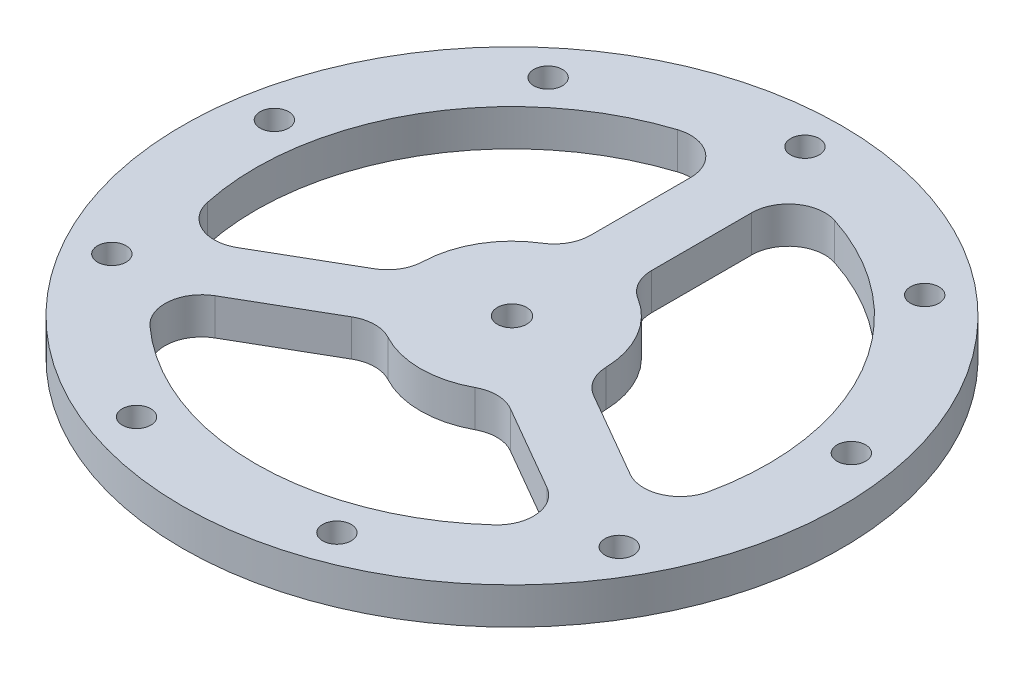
ISO-10303-21;
HEADER;
FILE_DESCRIPTION(('STEP AP214'),'2;1');
FILE_NAME('part.step','',(''),(''),'','','');
FILE_SCHEMA(('AUTOMOTIVE_DESIGN { 1 0 10303 214 1 1 1 1 }'));
ENDSEC;
DATA;
#1=APPLICATION_CONTEXT('core data for automotive mechanical design processes');
#2=APPLICATION_PROTOCOL_DEFINITION('international standard','automotive_design',2000,#1);
#3=PRODUCT_CONTEXT('',#1,'mechanical');
#4=PRODUCT('Part','Part','',(#3));
#5=PRODUCT_RELATED_PRODUCT_CATEGORY('part','',(#4));
#6=PRODUCT_DEFINITION_FORMATION('','',#4);
#7=PRODUCT_DEFINITION_CONTEXT('part definition',#1,'design');
#8=PRODUCT_DEFINITION('design','',#6,#7);
#9=PRODUCT_DEFINITION_SHAPE('','',#8);
#10=(LENGTH_UNIT() NAMED_UNIT(*) SI_UNIT(.MILLI.,.METRE.));
#11=(NAMED_UNIT(*) PLANE_ANGLE_UNIT() SI_UNIT($,.RADIAN.));
#12=(NAMED_UNIT(*) SI_UNIT($,.STERADIAN.) SOLID_ANGLE_UNIT());
#13=UNCERTAINTY_MEASURE_WITH_UNIT(LENGTH_MEASURE(1.E-05),#10,'distance_accuracy_value','');
#14=(GEOMETRIC_REPRESENTATION_CONTEXT(3) GLOBAL_UNCERTAINTY_ASSIGNED_CONTEXT((#13)) GLOBAL_UNIT_ASSIGNED_CONTEXT((#10,
#11,#12)) REPRESENTATION_CONTEXT('',''));
#15=CARTESIAN_POINT('',(0.,0.,0.));
#16=DIRECTION('',(0.,0.,1.));
#17=DIRECTION('',(1.,0.,0.));
#18=AXIS2_PLACEMENT_3D('',#15,#16,#17);
#19=CARTESIAN_POINT('',(0.,5.,0.));
#20=DIRECTION('',(0.,1.,0.));
#21=DIRECTION('',(0.,0.,1.));
#22=AXIS2_PLACEMENT_3D('',#19,#20,#21);
#23=PLANE('',#22);
#24=CARTESIAN_POINT('',(25.7115043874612,5.,-30.6417777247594));
#25=DIRECTION('',(0.,1.,0.));
#26=DIRECTION('',(-0.64278760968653,0.,0.766044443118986));
#27=AXIS2_PLACEMENT_3D('',#24,#25,#26);
#28=CIRCLE('',#27,1.95);
#29=CARTESIAN_POINT('',(24.4580685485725,5.,-29.1479910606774));
#30=VERTEX_POINT('',#29);
#31=EDGE_CURVE('E594',#30,#30,#28,.T.);
#32=ORIENTED_EDGE('',*,*,#31,.F.);
#33=EDGE_LOOP('',(#32));
#34=FACE_BOUND('',#33,.T.);
#35=CARTESIAN_POINT('',(39.3923101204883,5.,-6.94592710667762));
#36=DIRECTION('',(0.,1.,0.));
#37=DIRECTION('',(-0.984807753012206,0.,0.17364817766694));
#38=AXIS2_PLACEMENT_3D('',#35,#36,#37);
#39=CIRCLE('',#38,1.95);
#40=CARTESIAN_POINT('',(37.4719350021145,5.,-6.60731316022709));
#41=VERTEX_POINT('',#40);
#42=EDGE_CURVE('E600',#41,#41,#39,.T.);
#43=ORIENTED_EDGE('',*,*,#42,.F.);
#44=EDGE_LOOP('',(#43));
#45=FACE_BOUND('',#44,.T.);
#46=CARTESIAN_POINT('',(34.6410161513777,5.,19.9999999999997));
#47=DIRECTION('',(0.,1.,0.));
#48=DIRECTION('',(-0.866025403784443,0.,-0.499999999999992));
#49=AXIS2_PLACEMENT_3D('',#46,#47,#48);
#50=CIRCLE('',#49,1.95);
#51=CARTESIAN_POINT('',(32.9522666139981,5.,19.0249999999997));
#52=VERTEX_POINT('',#51);
#53=EDGE_CURVE('E606',#52,#52,#50,.T.);
#54=ORIENTED_EDGE('',*,*,#53,.F.);
#55=EDGE_LOOP('',(#54));
#56=FACE_BOUND('',#55,.T.);
#57=CARTESIAN_POINT('',(13.680805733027,5.,37.5877048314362));
#58=DIRECTION('',(0.,1.,0.));
#59=DIRECTION('',(-0.342020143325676,0.,-0.939692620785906));
#60=AXIS2_PLACEMENT_3D('',#57,#58,#59);
#61=CIRCLE('',#60,1.95);
#62=CARTESIAN_POINT('',(13.013866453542,5.,35.7553042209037));
#63=VERTEX_POINT('',#62);
#64=EDGE_CURVE('E612',#63,#63,#61,.T.);
#65=ORIENTED_EDGE('',*,*,#64,.F.);
#66=EDGE_LOOP('',(#65));
#67=FACE_BOUND('',#66,.T.);
#68=CARTESIAN_POINT('',(-13.6808057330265,5.,37.5877048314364));
#69=DIRECTION('',(0.,1.,0.));
#70=DIRECTION('',(0.342020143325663,0.,-0.939692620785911));
#71=AXIS2_PLACEMENT_3D('',#68,#69,#70);
#72=CIRCLE('',#71,1.95);
#73=CARTESIAN_POINT('',(-13.0138664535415,5.,35.7553042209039));
#74=VERTEX_POINT('',#73);
#75=EDGE_CURVE('E618',#74,#74,#72,.T.);
#76=ORIENTED_EDGE('',*,*,#75,.F.);
#77=EDGE_LOOP('',(#76));
#78=FACE_BOUND('',#77,.T.);
#79=CARTESIAN_POINT('',(-34.6410161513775,5.,20.0000000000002));
#80=DIRECTION('',(0.,1.,0.));
#81=DIRECTION('',(0.866025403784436,0.,-0.500000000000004));
#82=AXIS2_PLACEMENT_3D('',#79,#80,#81);
#83=CIRCLE('',#82,1.95);
#84=CARTESIAN_POINT('',(-32.9522666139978,5.,19.0250000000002));
#85=VERTEX_POINT('',#84);
#86=EDGE_CURVE('E624',#85,#85,#83,.T.);
#87=ORIENTED_EDGE('',*,*,#86,.F.);
#88=EDGE_LOOP('',(#87));
#89=FACE_BOUND('',#88,.T.);
#90=CARTESIAN_POINT('',(-39.3923101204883,5.,-6.9459271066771));
#91=DIRECTION('',(0.,1.,0.));
#92=DIRECTION('',(0.984807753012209,0.,0.173648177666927));
#93=AXIS2_PLACEMENT_3D('',#90,#91,#92);
#94=CIRCLE('',#93,1.95);
#95=CARTESIAN_POINT('',(-37.4719350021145,5.,-6.60731316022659));
#96=VERTEX_POINT('',#95);
#97=EDGE_CURVE('E630',#96,#96,#94,.T.);
#98=ORIENTED_EDGE('',*,*,#97,.F.);
#99=EDGE_LOOP('',(#98));
#100=FACE_BOUND('',#99,.T.);
#101=CARTESIAN_POINT('',(-25.7115043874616,5.,-30.6417777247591));
#102=DIRECTION('',(0.,1.,0.));
#103=DIRECTION('',(0.642787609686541,0.,0.766044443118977));
#104=AXIS2_PLACEMENT_3D('',#101,#102,#103);
#105=CIRCLE('',#104,1.95);
#106=CARTESIAN_POINT('',(-24.4580685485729,5.,-29.1479910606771));
#107=VERTEX_POINT('',#106);
#108=EDGE_CURVE('E588',#107,#107,#105,.T.);
#109=ORIENTED_EDGE('',*,*,#108,.F.);
#110=EDGE_LOOP('',(#109));
#111=FACE_BOUND('',#110,.T.);
#112=CARTESIAN_POINT('',(0.,5.,-40.));
#113=DIRECTION('',(0.,1.,0.));
#114=DIRECTION('',(0.,0.,1.));
#115=AXIS2_PLACEMENT_3D('',#112,#113,#114);
#116=CIRCLE('',#115,1.95);
#117=CARTESIAN_POINT('',(0.,5.,-38.05));
#118=VERTEX_POINT('',#117);
#119=EDGE_CURVE('E582',#118,#118,#116,.T.);
#120=ORIENTED_EDGE('',*,*,#119,.F.);
#121=EDGE_LOOP('',(#120));
#122=FACE_BOUND('',#121,.T.);
#123=CARTESIAN_POINT('',(0.,5.,0.));
#124=DIRECTION('',(0.,1.,0.));
#125=DIRECTION('',(0.,0.,1.));
#126=AXIS2_PLACEMENT_3D('',#123,#124,#125);
#127=CIRCLE('',#126,2.);
#128=CARTESIAN_POINT('',(0.,5.,2.));
#129=VERTEX_POINT('',#128);
#130=EDGE_CURVE('E485',#129,#129,#127,.T.);
#131=ORIENTED_EDGE('',*,*,#130,.F.);
#132=EDGE_LOOP('',(#131));
#133=FACE_BOUND('',#132,.T.);
#134=CARTESIAN_POINT('',(0.,5.,0.));
#135=DIRECTION('',(0.,1.,0.));
#136=DIRECTION('',(0.,0.,1.));
#137=AXIS2_PLACEMENT_3D('',#134,#135,#136);
#138=CIRCLE('',#137,45.);
#139=CARTESIAN_POINT('',(0.,5.,45.));
#140=VERTEX_POINT('',#139);
#141=EDGE_CURVE('E353',#140,#140,#138,.T.);
#142=ORIENTED_EDGE('',*,*,#141,.T.);
#143=EDGE_LOOP('',(#142));
#144=FACE_BOUND('',#143,.T.);
#145=DIRECTION('',(0.866025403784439,0.,0.5));
#146=VECTOR('',#145,1.);
#147=CARTESIAN_POINT('',(2.08333333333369,5.,-3.60843918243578));
#148=LINE('',#147,#146);
#149=CARTESIAN_POINT('',(14.9932778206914,5.,3.84512074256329));
#150=VERTEX_POINT('',#149);
#151=CARTESIAN_POINT('',(26.8215460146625,5.,10.6741745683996));
#152=VERTEX_POINT('',#151);
#153=EDGE_CURVE('E322',#150,#152,#148,.T.);
#154=ORIENTED_EDGE('',*,*,#153,.F.);
#155=CARTESIAN_POINT('',(17.4932778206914,5.,-0.485006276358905));
#156=DIRECTION('',(0.,1.,0.));
#157=DIRECTION('',(0.,0.,1.));
#158=AXIS2_PLACEMENT_3D('',#155,#156,#157);
#159=CIRCLE('',#158,5.);
#160=CARTESIAN_POINT('',(12.495198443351,5.,-0.346433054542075));
#161=VERTEX_POINT('',#160);
#162=EDGE_CURVE('E446',#150,#161,#159,.F.);
#163=ORIENTED_EDGE('',*,*,#162,.T.);
#164=CARTESIAN_POINT('',(0.,5.,0.));
#165=DIRECTION('',(0.,1.,0.));
#166=DIRECTION('',(0.,0.,1.));
#167=AXIS2_PLACEMENT_3D('',#164,#165,#166);
#168=CIRCLE('',#167,12.5);
#169=CARTESIAN_POINT('',(6.54761904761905,5.,-10.647942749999));
#170=VERTEX_POINT('',#169);
#171=EDGE_CURVE('E324',#161,#170,#168,.T.);
#172=ORIENTED_EDGE('',*,*,#171,.T.);
#173=CARTESIAN_POINT('',(9.16666666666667,5.,-14.9071198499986));
#174=DIRECTION('',(0.,1.,0.));
#175=DIRECTION('',(0.,0.,1.));
#176=AXIS2_PLACEMENT_3D('',#173,#174,#175);
#177=CIRCLE('',#176,5.);
#178=CARTESIAN_POINT('',(4.16666666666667,5.,-14.9071198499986));
#179=VERTEX_POINT('',#178);
#180=EDGE_CURVE('E450',#170,#179,#177,.F.);
#181=ORIENTED_EDGE('',*,*,#180,.T.);
#182=DIRECTION('',(0.,0.,1.));
#183=VECTOR('',#182,1.);
#184=CARTESIAN_POINT('',(4.16666666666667,5.,0.));
#185=LINE('',#184,#183);
#186=CARTESIAN_POINT('',(4.16666666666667,5.,-28.565227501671));
#187=VERTEX_POINT('',#186);
#188=EDGE_CURVE('E321',#179,#187,#185,.F.);
#189=ORIENTED_EDGE('',*,*,#188,.T.);
#190=CARTESIAN_POINT('',(9.16666666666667,5.,-28.565227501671));
#191=DIRECTION('',(0.,1.,0.));
#192=DIRECTION('',(0.,0.,1.));
#193=AXIS2_PLACEMENT_3D('',#190,#191,#192);
#194=CIRCLE('',#193,5.);
#195=CARTESIAN_POINT('',(10.6944444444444,5.,-33.3260987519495));
#196=VERTEX_POINT('',#195);
#197=EDGE_CURVE('E320',#187,#196,#194,.F.);
#198=ORIENTED_EDGE('',*,*,#197,.T.);
#199=CARTESIAN_POINT('',(0.,5.,0.));
#200=DIRECTION('',(0.,1.,0.));
#201=DIRECTION('',(0.,0.,1.));
#202=AXIS2_PLACEMENT_3D('',#199,#200,#201);
#203=CIRCLE('',#202,35.);
#204=CARTESIAN_POINT('',(34.2084703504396,5.,7.40138880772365));
#205=VERTEX_POINT('',#204);
#206=EDGE_CURVE('E312',#205,#196,#203,.T.);
#207=ORIENTED_EDGE('',*,*,#206,.F.);
#208=CARTESIAN_POINT('',(29.3215460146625,5.,6.34404754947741));
#209=DIRECTION('',(0.,1.,0.));
#210=DIRECTION('',(0.,0.,1.));
#211=AXIS2_PLACEMENT_3D('',#208,#209,#210);
#212=CIRCLE('',#211,5.);
#213=EDGE_CURVE('E295',#205,#152,#212,.F.);
#214=ORIENTED_EDGE('',*,*,#213,.T.);
#215=EDGE_LOOP('',(#154,#163,#172,#181,#189,#198,#207,#214));
#216=FACE_BOUND('',#215,.T.);
#217=DIRECTION('',(-0.866025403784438,0.,0.5));
#218=VECTOR('',#217,1.);
#219=CARTESIAN_POINT('',(2.08333333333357,5.,3.60843918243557));
#220=LINE('',#219,#218);
#221=CARTESIAN_POINT('',(-10.8266111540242,5.,11.0619991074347));
#222=VERTEX_POINT('',#221);
#223=CARTESIAN_POINT('',(-22.6548793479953,5.,17.891052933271));
#224=VERTEX_POINT('',#223);
#225=EDGE_CURVE('E332',#222,#224,#220,.T.);
#226=ORIENTED_EDGE('',*,*,#225,.F.);
#227=CARTESIAN_POINT('',(-8.32661115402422,5.,15.3921261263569));
#228=DIRECTION('',(0.,1.,0.));
#229=DIRECTION('',(0.,0.,1.));
#230=AXIS2_PLACEMENT_3D('',#227,#228,#229);
#231=CIRCLE('',#230,5.);
#232=CARTESIAN_POINT('',(-5.94757939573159,5.,10.9943758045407));
#233=VERTEX_POINT('',#232);
#234=EDGE_CURVE('E438',#222,#233,#231,.F.);
#235=ORIENTED_EDGE('',*,*,#234,.T.);
#236=CARTESIAN_POINT('',(0.,5.,0.));
#237=DIRECTION('',(0.,1.,0.));
#238=DIRECTION('',(0.,0.,1.));
#239=AXIS2_PLACEMENT_3D('',#236,#237,#238);
#240=CIRCLE('',#239,12.5);
#241=CARTESIAN_POINT('',(5.94757939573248,5.,10.9943758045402));
#242=VERTEX_POINT('',#241);
#243=EDGE_CURVE('E339',#233,#242,#240,.T.);
#244=ORIENTED_EDGE('',*,*,#243,.T.);
#245=CARTESIAN_POINT('',(8.32661115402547,5.,15.3921261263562));
#246=DIRECTION('',(0.,1.,0.));
#247=DIRECTION('',(0.,0.,1.));
#248=AXIS2_PLACEMENT_3D('',#245,#246,#247);
#249=CIRCLE('',#248,5.);
#250=CARTESIAN_POINT('',(10.8266111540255,5.,11.0619991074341));
#251=VERTEX_POINT('',#250);
#252=EDGE_CURVE('E442',#242,#251,#249,.F.);
#253=ORIENTED_EDGE('',*,*,#252,.T.);
#254=DIRECTION('',(0.866025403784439,0.,0.5));
#255=VECTOR('',#254,1.);
#256=CARTESIAN_POINT('',(8.12287392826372,5.,9.5009956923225));
#257=LINE('',#256,#255);
#258=CARTESIAN_POINT('',(22.6548793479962,5.,17.8910529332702));
#259=VERTEX_POINT('',#258);
#260=EDGE_CURVE('E337',#251,#259,#257,.T.);
#261=ORIENTED_EDGE('',*,*,#260,.T.);
#262=CARTESIAN_POINT('',(20.1548793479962,5.,22.2211799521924));
#263=DIRECTION('',(0.,1.,0.));
#264=DIRECTION('',(0.,0.,1.));
#265=AXIS2_PLACEMENT_3D('',#262,#263,#264);
#266=CIRCLE('',#265,5.);
#267=CARTESIAN_POINT('',(23.5140259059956,5.,25.9247099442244));
#268=VERTEX_POINT('',#267);
#269=EDGE_CURVE('E381',#259,#268,#266,.F.);
#270=ORIENTED_EDGE('',*,*,#269,.T.);
#271=CARTESIAN_POINT('',(0.,5.,0.));
#272=DIRECTION('',(0.,1.,0.));
#273=DIRECTION('',(0.,0.,1.));
#274=AXIS2_PLACEMENT_3D('',#271,#272,#273);
#275=CIRCLE('',#274,35.);
#276=CARTESIAN_POINT('',(-23.5140259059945,5.,25.9247099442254));
#277=VERTEX_POINT('',#276);
#278=EDGE_CURVE('E334',#277,#268,#275,.T.);
#279=ORIENTED_EDGE('',*,*,#278,.F.);
#280=CARTESIAN_POINT('',(-20.1548793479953,5.,22.2211799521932));
#281=DIRECTION('',(0.,1.,0.));
#282=DIRECTION('',(0.,0.,1.));
#283=AXIS2_PLACEMENT_3D('',#280,#281,#282);
#284=CIRCLE('',#283,5.);
#285=EDGE_CURVE('E386',#277,#224,#284,.F.);
#286=ORIENTED_EDGE('',*,*,#285,.T.);
#287=EDGE_LOOP('',(#226,#235,#244,#253,#261,#270,#279,#286));
#288=FACE_BOUND('',#287,.T.);
#289=DIRECTION('',(0.,0.,-1.));
#290=VECTOR('',#289,1.);
#291=CARTESIAN_POINT('',(-4.16666666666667,5.,0.));
#292=LINE('',#291,#290);
#293=CARTESIAN_POINT('',(-4.16666666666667,5.,-14.9071198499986));
#294=VERTEX_POINT('',#293);
#295=CARTESIAN_POINT('',(-4.16666666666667,5.,-28.565227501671));
#296=VERTEX_POINT('',#295);
#297=EDGE_CURVE('E342',#294,#296,#292,.T.);
#298=ORIENTED_EDGE('',*,*,#297,.F.);
#299=CARTESIAN_POINT('',(-9.16666666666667,5.,-14.9071198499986));
#300=DIRECTION('',(0.,1.,0.));
#301=DIRECTION('',(0.,0.,1.));
#302=AXIS2_PLACEMENT_3D('',#299,#300,#301);
#303=CIRCLE('',#302,5.);
#304=CARTESIAN_POINT('',(-6.54761904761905,5.,-10.647942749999));
#305=VERTEX_POINT('',#304);
#306=EDGE_CURVE('E142',#294,#305,#303,.F.);
#307=ORIENTED_EDGE('',*,*,#306,.T.);
#308=CARTESIAN_POINT('',(0.,5.,0.));
#309=DIRECTION('',(0.,1.,0.));
#310=DIRECTION('',(0.,0.,1.));
#311=AXIS2_PLACEMENT_3D('',#308,#309,#310);
#312=CIRCLE('',#311,12.5);
#313=CARTESIAN_POINT('',(-12.495198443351,5.,-0.346433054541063));
#314=VERTEX_POINT('',#313);
#315=EDGE_CURVE('E349',#305,#314,#312,.T.);
#316=ORIENTED_EDGE('',*,*,#315,.T.);
#317=CARTESIAN_POINT('',(-17.4932778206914,5.,-0.485006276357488));
#318=DIRECTION('',(0.,1.,0.));
#319=DIRECTION('',(0.,0.,1.));
#320=AXIS2_PLACEMENT_3D('',#317,#318,#319);
#321=CIRCLE('',#320,5.);
#322=CARTESIAN_POINT('',(-14.9932778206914,5.,3.84512074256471));
#323=VERTEX_POINT('',#322);
#324=EDGE_CURVE('E434',#314,#323,#321,.F.);
#325=ORIENTED_EDGE('',*,*,#324,.T.);
#326=DIRECTION('',(-0.866025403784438,0.,0.5));
#327=VECTOR('',#326,1.);
#328=CARTESIAN_POINT('',(-12.2895405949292,5.,2.28411732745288));
#329=LINE('',#328,#327);
#330=CARTESIAN_POINT('',(-26.8215460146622,5.,10.6741745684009));
#331=VERTEX_POINT('',#330);
#332=EDGE_CURVE('E347',#323,#331,#329,.T.);
#333=ORIENTED_EDGE('',*,*,#332,.T.);
#334=CARTESIAN_POINT('',(-29.3215460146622,5.,6.34404754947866));
#335=DIRECTION('',(0.,1.,0.));
#336=DIRECTION('',(0.,0.,1.));
#337=AXIS2_PLACEMENT_3D('',#334,#335,#336);
#338=CIRCLE('',#337,5.);
#339=CARTESIAN_POINT('',(-34.2084703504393,5.,7.4013888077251));
#340=VERTEX_POINT('',#339);
#341=EDGE_CURVE('E391',#331,#340,#338,.F.);
#342=ORIENTED_EDGE('',*,*,#341,.T.);
#343=CARTESIAN_POINT('',(0.,5.,0.));
#344=DIRECTION('',(0.,1.,0.));
#345=DIRECTION('',(0.,0.,1.));
#346=AXIS2_PLACEMENT_3D('',#343,#344,#345);
#347=CIRCLE('',#346,35.);
#348=CARTESIAN_POINT('',(-10.6944444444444,5.,-33.3260987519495));
#349=VERTEX_POINT('',#348);
#350=EDGE_CURVE('E344',#349,#340,#347,.T.);
#351=ORIENTED_EDGE('',*,*,#350,.F.);
#352=CARTESIAN_POINT('',(-9.16666666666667,5.,-28.565227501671));
#353=DIRECTION('',(0.,1.,0.));
#354=DIRECTION('',(0.,0.,1.));
#355=AXIS2_PLACEMENT_3D('',#352,#353,#354);
#356=CIRCLE('',#355,5.);
#357=EDGE_CURVE('E396',#349,#296,#356,.F.);
#358=ORIENTED_EDGE('',*,*,#357,.T.);
#359=EDGE_LOOP('',(#298,#307,#316,#325,#333,#342,#351,#358));
#360=FACE_BOUND('',#359,.T.);
#361=ADVANCED_FACE('F134',(#34,#45,#56,#67,#78,#89,#100,#111,#122,#133,#144,#216,#288,#360),#23,.T.);
#362=CARTESIAN_POINT('',(0.,0.,0.));
#363=DIRECTION('',(0.,1.,0.));
#364=DIRECTION('',(0.,0.,1.));
#365=AXIS2_PLACEMENT_3D('',#362,#363,#364);
#366=PLANE('',#365);
#367=CARTESIAN_POINT('',(25.7115043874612,0.,-30.6417777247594));
#368=DIRECTION('',(0.,1.,0.));
#369=DIRECTION('',(-0.64278760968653,0.,0.766044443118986));
#370=AXIS2_PLACEMENT_3D('',#367,#368,#369);
#371=CIRCLE('',#370,1.95);
#372=CARTESIAN_POINT('',(24.4580685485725,0.,-29.1479910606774));
#373=VERTEX_POINT('',#372);
#374=EDGE_CURVE('E597',#373,#373,#371,.T.);
#375=ORIENTED_EDGE('',*,*,#374,.T.);
#376=EDGE_LOOP('',(#375));
#377=FACE_BOUND('',#376,.T.);
#378=CARTESIAN_POINT('',(39.3923101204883,0.,-6.94592710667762));
#379=DIRECTION('',(0.,1.,0.));
#380=DIRECTION('',(-0.984807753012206,0.,0.17364817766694));
#381=AXIS2_PLACEMENT_3D('',#378,#379,#380);
#382=CIRCLE('',#381,1.95);
#383=CARTESIAN_POINT('',(37.4719350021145,0.,-6.60731316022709));
#384=VERTEX_POINT('',#383);
#385=EDGE_CURVE('E603',#384,#384,#382,.T.);
#386=ORIENTED_EDGE('',*,*,#385,.T.);
#387=EDGE_LOOP('',(#386));
#388=FACE_BOUND('',#387,.T.);
#389=CARTESIAN_POINT('',(34.6410161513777,0.,19.9999999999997));
#390=DIRECTION('',(0.,1.,0.));
#391=DIRECTION('',(-0.866025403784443,0.,-0.499999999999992));
#392=AXIS2_PLACEMENT_3D('',#389,#390,#391);
#393=CIRCLE('',#392,1.95);
#394=CARTESIAN_POINT('',(32.9522666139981,0.,19.0249999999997));
#395=VERTEX_POINT('',#394);
#396=EDGE_CURVE('E609',#395,#395,#393,.T.);
#397=ORIENTED_EDGE('',*,*,#396,.T.);
#398=EDGE_LOOP('',(#397));
#399=FACE_BOUND('',#398,.T.);
#400=CARTESIAN_POINT('',(13.680805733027,0.,37.5877048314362));
#401=DIRECTION('',(0.,1.,0.));
#402=DIRECTION('',(-0.342020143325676,0.,-0.939692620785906));
#403=AXIS2_PLACEMENT_3D('',#400,#401,#402);
#404=CIRCLE('',#403,1.95);
#405=CARTESIAN_POINT('',(13.013866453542,0.,35.7553042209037));
#406=VERTEX_POINT('',#405);
#407=EDGE_CURVE('E615',#406,#406,#404,.T.);
#408=ORIENTED_EDGE('',*,*,#407,.T.);
#409=EDGE_LOOP('',(#408));
#410=FACE_BOUND('',#409,.T.);
#411=CARTESIAN_POINT('',(-13.6808057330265,0.,37.5877048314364));
#412=DIRECTION('',(0.,1.,0.));
#413=DIRECTION('',(0.342020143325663,0.,-0.939692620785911));
#414=AXIS2_PLACEMENT_3D('',#411,#412,#413);
#415=CIRCLE('',#414,1.95);
#416=CARTESIAN_POINT('',(-13.0138664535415,0.,35.7553042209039));
#417=VERTEX_POINT('',#416);
#418=EDGE_CURVE('E621',#417,#417,#415,.T.);
#419=ORIENTED_EDGE('',*,*,#418,.T.);
#420=EDGE_LOOP('',(#419));
#421=FACE_BOUND('',#420,.T.);
#422=CARTESIAN_POINT('',(-34.6410161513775,0.,20.0000000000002));
#423=DIRECTION('',(0.,1.,0.));
#424=DIRECTION('',(0.866025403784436,0.,-0.500000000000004));
#425=AXIS2_PLACEMENT_3D('',#422,#423,#424);
#426=CIRCLE('',#425,1.95);
#427=CARTESIAN_POINT('',(-32.9522666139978,0.,19.0250000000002));
#428=VERTEX_POINT('',#427);
#429=EDGE_CURVE('E627',#428,#428,#426,.T.);
#430=ORIENTED_EDGE('',*,*,#429,.T.);
#431=EDGE_LOOP('',(#430));
#432=FACE_BOUND('',#431,.T.);
#433=CARTESIAN_POINT('',(-39.3923101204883,0.,-6.9459271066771));
#434=DIRECTION('',(0.,1.,0.));
#435=DIRECTION('',(0.984807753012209,0.,0.173648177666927));
#436=AXIS2_PLACEMENT_3D('',#433,#434,#435);
#437=CIRCLE('',#436,1.95);
#438=CARTESIAN_POINT('',(-37.4719350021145,0.,-6.60731316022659));
#439=VERTEX_POINT('',#438);
#440=EDGE_CURVE('E591',#439,#439,#437,.T.);
#441=ORIENTED_EDGE('',*,*,#440,.T.);
#442=EDGE_LOOP('',(#441));
#443=FACE_BOUND('',#442,.T.);
#444=CARTESIAN_POINT('',(-25.7115043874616,0.,-30.6417777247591));
#445=DIRECTION('',(0.,1.,0.));
#446=DIRECTION('',(0.642787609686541,0.,0.766044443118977));
#447=AXIS2_PLACEMENT_3D('',#444,#445,#446);
#448=CIRCLE('',#447,1.95);
#449=CARTESIAN_POINT('',(-24.4580685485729,0.,-29.1479910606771));
#450=VERTEX_POINT('',#449);
#451=EDGE_CURVE('E585',#450,#450,#448,.T.);
#452=ORIENTED_EDGE('',*,*,#451,.T.);
#453=EDGE_LOOP('',(#452));
#454=FACE_BOUND('',#453,.T.);
#455=CARTESIAN_POINT('',(0.,0.,-40.));
#456=DIRECTION('',(0.,1.,0.));
#457=DIRECTION('',(0.,0.,1.));
#458=AXIS2_PLACEMENT_3D('',#455,#456,#457);
#459=CIRCLE('',#458,1.95);
#460=CARTESIAN_POINT('',(0.,0.,-38.05));
#461=VERTEX_POINT('',#460);
#462=EDGE_CURVE('E581',#461,#461,#459,.T.);
#463=ORIENTED_EDGE('',*,*,#462,.T.);
#464=EDGE_LOOP('',(#463));
#465=FACE_BOUND('',#464,.T.);
#466=CARTESIAN_POINT('',(0.,0.,0.));
#467=DIRECTION('',(0.,1.,0.));
#468=DIRECTION('',(0.,0.,1.));
#469=AXIS2_PLACEMENT_3D('',#466,#467,#468);
#470=CIRCLE('',#469,12.5);
#471=CARTESIAN_POINT('',(-5.94757939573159,0.,10.9943758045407));
#472=VERTEX_POINT('',#471);
#473=CARTESIAN_POINT('',(5.94757939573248,0.,10.9943758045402));
#474=VERTEX_POINT('',#473);
#475=EDGE_CURVE('E576',#472,#474,#470,.T.);
#476=ORIENTED_EDGE('',*,*,#475,.F.);
#477=CARTESIAN_POINT('',(-8.32661115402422,0.,15.3921261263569));
#478=DIRECTION('',(0.,1.,0.));
#479=DIRECTION('',(0.,0.,1.));
#480=AXIS2_PLACEMENT_3D('',#477,#478,#479);
#481=CIRCLE('',#480,5.);
#482=CARTESIAN_POINT('',(-10.8266111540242,0.,11.0619991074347));
#483=VERTEX_POINT('',#482);
#484=EDGE_CURVE('E440',#472,#483,#481,.T.);
#485=ORIENTED_EDGE('',*,*,#484,.T.);
#486=DIRECTION('',(-0.866025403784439,0.,0.5));
#487=VECTOR('',#486,1.);
#488=CARTESIAN_POINT('',(2.08333333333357,0.,3.60843918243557));
#489=LINE('',#488,#487);
#490=CARTESIAN_POINT('',(-22.6548793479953,0.,17.891052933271));
#491=VERTEX_POINT('',#490);
#492=EDGE_CURVE('E570',#483,#491,#489,.T.);
#493=ORIENTED_EDGE('',*,*,#492,.T.);
#494=CARTESIAN_POINT('',(-20.1548793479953,0.,22.2211799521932));
#495=DIRECTION('',(0.,1.,0.));
#496=DIRECTION('',(0.,0.,1.));
#497=AXIS2_PLACEMENT_3D('',#494,#495,#496);
#498=CIRCLE('',#497,5.);
#499=CARTESIAN_POINT('',(-23.5140259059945,0.,25.9247099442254));
#500=VERTEX_POINT('',#499);
#501=EDGE_CURVE('E389',#491,#500,#498,.T.);
#502=ORIENTED_EDGE('',*,*,#501,.T.);
#503=CARTESIAN_POINT('',(0.,0.,0.));
#504=DIRECTION('',(0.,1.,0.));
#505=DIRECTION('',(0.,0.,1.));
#506=AXIS2_PLACEMENT_3D('',#503,#504,#505);
#507=CIRCLE('',#506,35.);
#508=CARTESIAN_POINT('',(23.5140259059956,0.,25.9247099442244));
#509=VERTEX_POINT('',#508);
#510=EDGE_CURVE('E567',#500,#509,#507,.T.);
#511=ORIENTED_EDGE('',*,*,#510,.T.);
#512=CARTESIAN_POINT('',(20.1548793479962,0.,22.2211799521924));
#513=DIRECTION('',(0.,1.,0.));
#514=DIRECTION('',(0.,0.,1.));
#515=AXIS2_PLACEMENT_3D('',#512,#513,#514);
#516=CIRCLE('',#515,5.);
#517=CARTESIAN_POINT('',(22.6548793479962,0.,17.8910529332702));
#518=VERTEX_POINT('',#517);
#519=EDGE_CURVE('E383',#509,#518,#516,.T.);
#520=ORIENTED_EDGE('',*,*,#519,.T.);
#521=DIRECTION('',(0.866025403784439,0.,0.5));
#522=VECTOR('',#521,1.);
#523=CARTESIAN_POINT('',(-2.08333333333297,0.,3.60843918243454));
#524=LINE('',#523,#522);
#525=CARTESIAN_POINT('',(10.8266111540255,0.,11.0619991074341));
#526=VERTEX_POINT('',#525);
#527=EDGE_CURVE('E471',#526,#518,#524,.T.);
#528=ORIENTED_EDGE('',*,*,#527,.F.);
#529=CARTESIAN_POINT('',(8.32661115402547,0.,15.3921261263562));
#530=DIRECTION('',(0.,1.,0.));
#531=DIRECTION('',(0.,0.,1.));
#532=AXIS2_PLACEMENT_3D('',#529,#530,#531);
#533=CIRCLE('',#532,5.);
#534=EDGE_CURVE('E444',#526,#474,#533,.T.);
#535=ORIENTED_EDGE('',*,*,#534,.T.);
#536=EDGE_LOOP('',(#476,#485,#493,#502,#511,#520,#528,#535));
#537=FACE_BOUND('',#536,.T.);
#538=CARTESIAN_POINT('',(0.,0.,0.));
#539=DIRECTION('',(0.,1.,0.));
#540=DIRECTION('',(0.,0.,1.));
#541=AXIS2_PLACEMENT_3D('',#538,#539,#540);
#542=CIRCLE('',#541,45.);
#543=CARTESIAN_POINT('',(0.,0.,45.));
#544=VERTEX_POINT('',#543);
#545=EDGE_CURVE('E488',#544,#544,#542,.T.);
#546=ORIENTED_EDGE('',*,*,#545,.F.);
#547=EDGE_LOOP('',(#546));
#548=FACE_BOUND('',#547,.T.);
#549=CARTESIAN_POINT('',(0.,0.,0.));
#550=DIRECTION('',(0.,1.,0.));
#551=DIRECTION('',(0.,0.,1.));
#552=AXIS2_PLACEMENT_3D('',#549,#550,#551);
#553=CIRCLE('',#552,2.);
#554=CARTESIAN_POINT('',(0.,0.,2.));
#555=VERTEX_POINT('',#554);
#556=EDGE_CURVE('E352',#555,#555,#553,.T.);
#557=ORIENTED_EDGE('',*,*,#556,.T.);
#558=EDGE_LOOP('',(#557));
#559=FACE_BOUND('',#558,.T.);
#560=CARTESIAN_POINT('',(0.,0.,0.));
#561=DIRECTION('',(0.,1.,0.));
#562=DIRECTION('',(0.,0.,1.));
#563=AXIS2_PLACEMENT_3D('',#560,#561,#562);
#564=CIRCLE('',#563,12.5);
#565=CARTESIAN_POINT('',(12.495198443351,0.,-0.346433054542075));
#566=VERTEX_POINT('',#565);
#567=CARTESIAN_POINT('',(6.54761904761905,0.,-10.647942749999));
#568=VERTEX_POINT('',#567);
#569=EDGE_CURVE('E476',#566,#568,#564,.T.);
#570=ORIENTED_EDGE('',*,*,#569,.F.);
#571=CARTESIAN_POINT('',(17.4932778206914,0.,-0.485006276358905));
#572=DIRECTION('',(0.,1.,0.));
#573=DIRECTION('',(0.,0.,1.));
#574=AXIS2_PLACEMENT_3D('',#571,#572,#573);
#575=CIRCLE('',#574,5.);
#576=CARTESIAN_POINT('',(14.9932778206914,0.,3.84512074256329));
#577=VERTEX_POINT('',#576);
#578=EDGE_CURVE('E448',#566,#577,#575,.T.);
#579=ORIENTED_EDGE('',*,*,#578,.T.);
#580=DIRECTION('',(0.866025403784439,0.,0.5));
#581=VECTOR('',#580,1.);
#582=CARTESIAN_POINT('',(2.08333333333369,0.,-3.60843918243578));
#583=LINE('',#582,#581);
#584=CARTESIAN_POINT('',(26.8215460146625,0.,10.6741745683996));
#585=VERTEX_POINT('',#584);
#586=EDGE_CURVE('E479',#577,#585,#583,.T.);
#587=ORIENTED_EDGE('',*,*,#586,.T.);
#588=CARTESIAN_POINT('',(29.3215460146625,0.,6.34404754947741));
#589=DIRECTION('',(0.,1.,0.));
#590=DIRECTION('',(0.,0.,1.));
#591=AXIS2_PLACEMENT_3D('',#588,#589,#590);
#592=CIRCLE('',#591,5.);
#593=CARTESIAN_POINT('',(34.2084703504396,0.,7.40138880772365));
#594=VERTEX_POINT('',#593);
#595=EDGE_CURVE('E305',#585,#594,#592,.T.);
#596=ORIENTED_EDGE('',*,*,#595,.T.);
#597=CARTESIAN_POINT('',(0.,0.,0.));
#598=DIRECTION('',(0.,1.,0.));
#599=DIRECTION('',(0.,0.,1.));
#600=AXIS2_PLACEMENT_3D('',#597,#598,#599);
#601=CIRCLE('',#600,35.);
#602=CARTESIAN_POINT('',(10.6944444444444,0.,-33.3260987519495));
#603=VERTEX_POINT('',#602);
#604=EDGE_CURVE('E315',#594,#603,#601,.T.);
#605=ORIENTED_EDGE('',*,*,#604,.T.);
#606=CARTESIAN_POINT('',(9.16666666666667,0.,-28.565227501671));
#607=DIRECTION('',(0.,1.,0.));
#608=DIRECTION('',(0.,0.,1.));
#609=AXIS2_PLACEMENT_3D('',#606,#607,#608);
#610=CIRCLE('',#609,5.);
#611=CARTESIAN_POINT('',(4.16666666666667,0.,-28.565227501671));
#612=VERTEX_POINT('',#611);
#613=EDGE_CURVE('E402',#603,#612,#610,.T.);
#614=ORIENTED_EDGE('',*,*,#613,.T.);
#615=DIRECTION('',(0.,0.,-1.));
#616=VECTOR('',#615,1.);
#617=CARTESIAN_POINT('',(4.16666666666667,0.,0.));
#618=LINE('',#617,#616);
#619=CARTESIAN_POINT('',(4.16666666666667,0.,-14.9071198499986));
#620=VERTEX_POINT('',#619);
#621=EDGE_CURVE('E326',#620,#612,#618,.T.);
#622=ORIENTED_EDGE('',*,*,#621,.F.);
#623=CARTESIAN_POINT('',(9.16666666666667,0.,-14.9071198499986));
#624=DIRECTION('',(0.,1.,0.));
#625=DIRECTION('',(0.,0.,1.));
#626=AXIS2_PLACEMENT_3D('',#623,#624,#625);
#627=CIRCLE('',#626,5.);
#628=EDGE_CURVE('E452',#620,#568,#627,.T.);
#629=ORIENTED_EDGE('',*,*,#628,.T.);
#630=EDGE_LOOP('',(#570,#579,#587,#596,#605,#614,#622,#629));
#631=FACE_BOUND('',#630,.T.);
#632=CARTESIAN_POINT('',(0.,0.,0.));
#633=DIRECTION('',(0.,1.,0.));
#634=DIRECTION('',(0.,0.,1.));
#635=AXIS2_PLACEMENT_3D('',#632,#633,#634);
#636=CIRCLE('',#635,12.5);
#637=CARTESIAN_POINT('',(-6.54761904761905,0.,-10.647942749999));
#638=VERTEX_POINT('',#637);
#639=CARTESIAN_POINT('',(-12.495198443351,0.,-0.346433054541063));
#640=VERTEX_POINT('',#639);
#641=EDGE_CURVE('E466',#638,#640,#636,.T.);
#642=ORIENTED_EDGE('',*,*,#641,.F.);
#643=CARTESIAN_POINT('',(-9.16666666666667,0.,-14.9071198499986));
#644=DIRECTION('',(0.,1.,0.));
#645=DIRECTION('',(0.,0.,1.));
#646=AXIS2_PLACEMENT_3D('',#643,#644,#645);
#647=CIRCLE('',#646,5.);
#648=CARTESIAN_POINT('',(-4.16666666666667,0.,-14.9071198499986));
#649=VERTEX_POINT('',#648);
#650=EDGE_CURVE('E12',#638,#649,#647,.T.);
#651=ORIENTED_EDGE('',*,*,#650,.T.);
#652=DIRECTION('',(0.,0.,-1.));
#653=VECTOR('',#652,1.);
#654=CARTESIAN_POINT('',(-4.16666666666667,0.,0.));
#655=LINE('',#654,#653);
#656=CARTESIAN_POINT('',(-4.16666666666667,0.,-28.565227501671));
#657=VERTEX_POINT('',#656);
#658=EDGE_CURVE('E462',#649,#657,#655,.T.);
#659=ORIENTED_EDGE('',*,*,#658,.T.);
#660=CARTESIAN_POINT('',(-9.16666666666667,0.,-28.565227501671));
#661=DIRECTION('',(0.,1.,0.));
#662=DIRECTION('',(0.,0.,1.));
#663=AXIS2_PLACEMENT_3D('',#660,#661,#662);
#664=CIRCLE('',#663,5.);
#665=CARTESIAN_POINT('',(-10.6944444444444,0.,-33.3260987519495));
#666=VERTEX_POINT('',#665);
#667=EDGE_CURVE('E399',#657,#666,#664,.T.);
#668=ORIENTED_EDGE('',*,*,#667,.T.);
#669=CARTESIAN_POINT('',(0.,0.,0.));
#670=DIRECTION('',(0.,1.,0.));
#671=DIRECTION('',(0.,0.,1.));
#672=AXIS2_PLACEMENT_3D('',#669,#670,#671);
#673=CIRCLE('',#672,35.);
#674=CARTESIAN_POINT('',(-34.2084703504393,0.,7.4013888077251));
#675=VERTEX_POINT('',#674);
#676=EDGE_CURVE('E465',#666,#675,#673,.T.);
#677=ORIENTED_EDGE('',*,*,#676,.T.);
#678=CARTESIAN_POINT('',(-29.3215460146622,0.,6.34404754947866));
#679=DIRECTION('',(0.,1.,0.));
#680=DIRECTION('',(0.,0.,1.));
#681=AXIS2_PLACEMENT_3D('',#678,#679,#680);
#682=CIRCLE('',#681,5.);
#683=CARTESIAN_POINT('',(-26.8215460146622,0.,10.6741745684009));
#684=VERTEX_POINT('',#683);
#685=EDGE_CURVE('E393',#675,#684,#682,.T.);
#686=ORIENTED_EDGE('',*,*,#685,.T.);
#687=DIRECTION('',(-0.866025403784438,0.,0.5));
#688=VECTOR('',#687,1.);
#689=CARTESIAN_POINT('',(-2.0833333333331,0.,-3.60843918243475));
#690=LINE('',#689,#688);
#691=CARTESIAN_POINT('',(-14.9932778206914,0.,3.84512074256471));
#692=VERTEX_POINT('',#691);
#693=EDGE_CURVE('E469',#692,#684,#690,.T.);
#694=ORIENTED_EDGE('',*,*,#693,.F.);
#695=CARTESIAN_POINT('',(-17.4932778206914,0.,-0.485006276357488));
#696=DIRECTION('',(0.,1.,0.));
#697=DIRECTION('',(0.,0.,1.));
#698=AXIS2_PLACEMENT_3D('',#695,#696,#697);
#699=CIRCLE('',#698,5.);
#700=EDGE_CURVE('E436',#692,#640,#699,.T.);
#701=ORIENTED_EDGE('',*,*,#700,.T.);
#702=EDGE_LOOP('',(#642,#651,#659,#668,#677,#686,#694,#701));
#703=FACE_BOUND('',#702,.T.);
#704=ADVANCED_FACE('F495',(#377,#388,#399,#410,#421,#432,#443,#454,#465,#537,#548,#559,#631,
#703),#366,.F.);
#705=CARTESIAN_POINT('',(0.,5.,0.));
#706=DIRECTION('',(0.,-1.,0.));
#707=DIRECTION('',(0.,0.,-1.));
#708=AXIS2_PLACEMENT_3D('',#705,#706,#707);
#709=CYLINDRICAL_SURFACE('',#708,45.);
#710=ORIENTED_EDGE('',*,*,#141,.F.);
#711=EDGE_LOOP('',(#710));
#712=FACE_BOUND('',#711,.T.);
#713=ORIENTED_EDGE('',*,*,#545,.T.);
#714=EDGE_LOOP('',(#713));
#715=FACE_BOUND('',#714,.T.);
#716=ADVANCED_FACE('F493',(#712,#715),#709,.T.);
#717=CARTESIAN_POINT('',(0.,0.,0.));
#718=DIRECTION('',(0.,1.,0.));
#719=DIRECTION('',(0.,0.,1.));
#720=AXIS2_PLACEMENT_3D('',#717,#718,#719);
#721=CYLINDRICAL_SURFACE('',#720,2.);
#722=ORIENTED_EDGE('',*,*,#130,.T.);
#723=EDGE_LOOP('',(#722));
#724=FACE_BOUND('',#723,.T.);
#725=ORIENTED_EDGE('',*,*,#556,.F.);
#726=EDGE_LOOP('',(#725));
#727=FACE_BOUND('',#726,.T.);
#728=ADVANCED_FACE('F544',(#724,#727),#721,.F.);
#729=CARTESIAN_POINT('',(0.,0.,0.));
#730=DIRECTION('',(0.,1.,0.));
#731=DIRECTION('',(0.,0.,1.));
#732=AXIS2_PLACEMENT_3D('',#729,#730,#731);
#733=CYLINDRICAL_SURFACE('',#732,12.5);
#734=ORIENTED_EDGE('',*,*,#171,.F.);
#735=DIRECTION('',(0.,1.,0.));
#736=VECTOR('',#735,1.);
#737=CARTESIAN_POINT('',(12.495198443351,0.,-0.346433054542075));
#738=LINE('',#737,#736);
#739=EDGE_CURVE('E428',#161,#566,#738,.F.);
#740=ORIENTED_EDGE('',*,*,#739,.T.);
#741=ORIENTED_EDGE('',*,*,#569,.T.);
#742=DIRECTION('',(0.,1.,0.));
#743=VECTOR('',#742,1.);
#744=CARTESIAN_POINT('',(6.54761904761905,0.,-10.647942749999));
#745=LINE('',#744,#743);
#746=EDGE_CURVE('E425',#568,#170,#745,.T.);
#747=ORIENTED_EDGE('',*,*,#746,.T.);
#748=EDGE_LOOP('',(#734,#740,#741,#747));
#749=FACE_BOUND('',#748,.T.);
#750=ADVANCED_FACE('F657',(#749),#733,.T.);
#751=CARTESIAN_POINT('',(4.16666666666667,0.,0.));
#752=DIRECTION('',(1.,0.,0.));
#753=DIRECTION('',(0.,0.,-1.));
#754=AXIS2_PLACEMENT_3D('',#751,#752,#753);
#755=PLANE('',#754);
#756=ORIENTED_EDGE('',*,*,#188,.F.);
#757=DIRECTION('',(0.,-1.,0.));
#758=VECTOR('',#757,1.);
#759=CARTESIAN_POINT('',(4.16666666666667,0.,-14.9071198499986));
#760=LINE('',#759,#758);
#761=EDGE_CURVE('E430',#179,#620,#760,.T.);
#762=ORIENTED_EDGE('',*,*,#761,.T.);
#763=ORIENTED_EDGE('',*,*,#621,.T.);
#764=DIRECTION('',(0.,1.,0.));
#765=VECTOR('',#764,1.);
#766=CARTESIAN_POINT('',(4.16666666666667,0.,-28.565227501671));
#767=LINE('',#766,#765);
#768=EDGE_CURVE('E306',#612,#187,#767,.T.);
#769=ORIENTED_EDGE('',*,*,#768,.T.);
#770=EDGE_LOOP('',(#756,#762,#763,#769));
#771=FACE_BOUND('',#770,.T.);
#772=ADVANCED_FACE('F661',(#771),#755,.T.);
#773=CARTESIAN_POINT('',(0.,0.,0.));
#774=DIRECTION('',(0.,1.,0.));
#775=DIRECTION('',(0.,0.,1.));
#776=AXIS2_PLACEMENT_3D('',#773,#774,#775);
#777=CYLINDRICAL_SURFACE('',#776,35.);
#778=ORIENTED_EDGE('',*,*,#604,.F.);
#779=DIRECTION('',(0.,1.,0.));
#780=VECTOR('',#779,1.);
#781=CARTESIAN_POINT('',(34.2084703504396,0.,7.40138880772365));
#782=LINE('',#781,#780);
#783=EDGE_CURVE('E299',#594,#205,#782,.T.);
#784=ORIENTED_EDGE('',*,*,#783,.T.);
#785=ORIENTED_EDGE('',*,*,#206,.T.);
#786=DIRECTION('',(0.,1.,0.));
#787=VECTOR('',#786,1.);
#788=CARTESIAN_POINT('',(10.6944444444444,0.,-33.3260987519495));
#789=LINE('',#788,#787);
#790=EDGE_CURVE('E316',#196,#603,#789,.F.);
#791=ORIENTED_EDGE('',*,*,#790,.T.);
#792=EDGE_LOOP('',(#778,#784,#785,#791));
#793=FACE_BOUND('',#792,.T.);
#794=ADVANCED_FACE('F311',(#793),#777,.F.);
#795=CARTESIAN_POINT('',(2.08333333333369,0.,-3.60843918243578));
#796=DIRECTION('',(-0.5,0.,0.866025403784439));
#797=DIRECTION('',(0.866025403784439,0.,0.5));
#798=AXIS2_PLACEMENT_3D('',#795,#796,#797);
#799=PLANE('',#798);
#800=ORIENTED_EDGE('',*,*,#586,.F.);
#801=DIRECTION('',(0.,1.,0.));
#802=VECTOR('',#801,1.);
#803=CARTESIAN_POINT('',(14.9932778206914,0.,3.84512074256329));
#804=LINE('',#803,#802);
#805=EDGE_CURVE('E422',#577,#150,#804,.T.);
#806=ORIENTED_EDGE('',*,*,#805,.T.);
#807=ORIENTED_EDGE('',*,*,#153,.T.);
#808=DIRECTION('',(0.,-1.,0.));
#809=VECTOR('',#808,1.);
#810=CARTESIAN_POINT('',(26.8215460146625,0.,10.6741745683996));
#811=LINE('',#810,#809);
#812=EDGE_CURVE('E301',#152,#585,#811,.T.);
#813=ORIENTED_EDGE('',*,*,#812,.T.);
#814=EDGE_LOOP('',(#800,#806,#807,#813));
#815=FACE_BOUND('',#814,.T.);
#816=ADVANCED_FACE('F670',(#815),#799,.F.);
#817=CARTESIAN_POINT('',(0.,0.,0.));
#818=DIRECTION('',(0.,1.,0.));
#819=DIRECTION('',(0.,0.,1.));
#820=AXIS2_PLACEMENT_3D('',#817,#818,#819);
#821=CYLINDRICAL_SURFACE('',#820,12.5);
#822=ORIENTED_EDGE('',*,*,#243,.F.);
#823=DIRECTION('',(0.,1.,0.));
#824=VECTOR('',#823,1.);
#825=CARTESIAN_POINT('',(-5.94757939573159,0.,10.9943758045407));
#826=LINE('',#825,#824);
#827=EDGE_CURVE('E418',#233,#472,#826,.F.);
#828=ORIENTED_EDGE('',*,*,#827,.T.);
#829=ORIENTED_EDGE('',*,*,#475,.T.);
#830=DIRECTION('',(0.,1.,0.));
#831=VECTOR('',#830,1.);
#832=CARTESIAN_POINT('',(5.94757939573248,0.,10.9943758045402));
#833=LINE('',#832,#831);
#834=EDGE_CURVE('E415',#474,#242,#833,.T.);
#835=ORIENTED_EDGE('',*,*,#834,.T.);
#836=EDGE_LOOP('',(#822,#828,#829,#835));
#837=FACE_BOUND('',#836,.T.);
#838=ADVANCED_FACE('F673',(#837),#821,.T.);
#839=CARTESIAN_POINT('',(-2.08333333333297,0.,3.60843918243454));
#840=DIRECTION('',(-0.5,0.,0.866025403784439));
#841=DIRECTION('',(0.866025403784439,0.,0.5));
#842=AXIS2_PLACEMENT_3D('',#839,#840,#841);
#843=PLANE('',#842);
#844=ORIENTED_EDGE('',*,*,#260,.F.);
#845=DIRECTION('',(0.,-1.,0.));
#846=VECTOR('',#845,1.);
#847=CARTESIAN_POINT('',(10.8266111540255,0.,11.0619991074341));
#848=LINE('',#847,#846);
#849=EDGE_CURVE('E420',#251,#526,#848,.T.);
#850=ORIENTED_EDGE('',*,*,#849,.T.);
#851=ORIENTED_EDGE('',*,*,#527,.T.);
#852=DIRECTION('',(0.,1.,0.));
#853=VECTOR('',#852,1.);
#854=CARTESIAN_POINT('',(22.6548793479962,0.,17.8910529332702));
#855=LINE('',#854,#853);
#856=EDGE_CURVE('E356',#518,#259,#855,.T.);
#857=ORIENTED_EDGE('',*,*,#856,.T.);
#858=EDGE_LOOP('',(#844,#850,#851,#857));
#859=FACE_BOUND('',#858,.T.);
#860=ADVANCED_FACE('F688',(#859),#843,.T.);
#861=CARTESIAN_POINT('',(0.,0.,0.));
#862=DIRECTION('',(0.,1.,0.));
#863=DIRECTION('',(0.,0.,1.));
#864=AXIS2_PLACEMENT_3D('',#861,#862,#863);
#865=CYLINDRICAL_SURFACE('',#864,35.);
#866=ORIENTED_EDGE('',*,*,#278,.T.);
#867=DIRECTION('',(0.,1.,0.));
#868=VECTOR('',#867,1.);
#869=CARTESIAN_POINT('',(23.5140259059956,0.,25.9247099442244));
#870=LINE('',#869,#868);
#871=EDGE_CURVE('E362',#268,#509,#870,.F.);
#872=ORIENTED_EDGE('',*,*,#871,.T.);
#873=ORIENTED_EDGE('',*,*,#510,.F.);
#874=DIRECTION('',(0.,1.,0.));
#875=VECTOR('',#874,1.);
#876=CARTESIAN_POINT('',(-23.5140259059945,0.,25.9247099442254));
#877=LINE('',#876,#875);
#878=EDGE_CURVE('E359',#500,#277,#877,.T.);
#879=ORIENTED_EDGE('',*,*,#878,.T.);
#880=EDGE_LOOP('',(#866,#872,#873,#879));
#881=FACE_BOUND('',#880,.T.);
#882=ADVANCED_FACE('F572',(#881),#865,.F.);
#883=CARTESIAN_POINT('',(2.08333333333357,0.,3.60843918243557));
#884=DIRECTION('',(-0.5,0.,-0.866025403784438));
#885=DIRECTION('',(-0.866025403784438,0.,0.5));
#886=AXIS2_PLACEMENT_3D('',#883,#884,#885);
#887=PLANE('',#886);
#888=ORIENTED_EDGE('',*,*,#492,.F.);
#889=DIRECTION('',(0.,1.,0.));
#890=VECTOR('',#889,1.);
#891=CARTESIAN_POINT('',(-10.8266111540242,0.,11.0619991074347));
#892=LINE('',#891,#890);
#893=EDGE_CURVE('E412',#483,#222,#892,.T.);
#894=ORIENTED_EDGE('',*,*,#893,.T.);
#895=ORIENTED_EDGE('',*,*,#225,.T.);
#896=DIRECTION('',(0.,-1.,0.));
#897=VECTOR('',#896,1.);
#898=CARTESIAN_POINT('',(-22.6548793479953,0.,17.891052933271));
#899=LINE('',#898,#897);
#900=EDGE_CURVE('E364',#224,#491,#899,.T.);
#901=ORIENTED_EDGE('',*,*,#900,.T.);
#902=EDGE_LOOP('',(#888,#894,#895,#901));
#903=FACE_BOUND('',#902,.T.);
#904=ADVANCED_FACE('F679',(#903),#887,.F.);
#905=CARTESIAN_POINT('',(0.,0.,0.));
#906=DIRECTION('',(0.,1.,0.));
#907=DIRECTION('',(0.,0.,1.));
#908=AXIS2_PLACEMENT_3D('',#905,#906,#907);
#909=CYLINDRICAL_SURFACE('',#908,12.5);
#910=ORIENTED_EDGE('',*,*,#641,.T.);
#911=DIRECTION('',(0.,1.,0.));
#912=VECTOR('',#911,1.);
#913=CARTESIAN_POINT('',(-12.495198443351,0.,-0.346433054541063));
#914=LINE('',#913,#912);
#915=EDGE_CURVE('E407',#640,#314,#914,.T.);
#916=ORIENTED_EDGE('',*,*,#915,.T.);
#917=ORIENTED_EDGE('',*,*,#315,.F.);
#918=DIRECTION('',(0.,1.,0.));
#919=VECTOR('',#918,1.);
#920=CARTESIAN_POINT('',(-6.54761904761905,0.,-10.647942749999));
#921=LINE('',#920,#919);
#922=EDGE_CURVE('E405',#305,#638,#921,.F.);
#923=ORIENTED_EDGE('',*,*,#922,.T.);
#924=EDGE_LOOP('',(#910,#916,#917,#923));
#925=FACE_BOUND('',#924,.T.);
#926=ADVANCED_FACE('F458',(#925),#909,.T.);
#927=CARTESIAN_POINT('',(-2.0833333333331,0.,-3.60843918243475));
#928=DIRECTION('',(-0.5,0.,-0.866025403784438));
#929=DIRECTION('',(-0.866025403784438,0.,0.5));
#930=AXIS2_PLACEMENT_3D('',#927,#928,#929);
#931=PLANE('',#930);
#932=ORIENTED_EDGE('',*,*,#332,.F.);
#933=DIRECTION('',(0.,-1.,0.));
#934=VECTOR('',#933,1.);
#935=CARTESIAN_POINT('',(-14.9932778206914,0.,3.84512074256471));
#936=LINE('',#935,#934);
#937=EDGE_CURVE('E410',#323,#692,#936,.T.);
#938=ORIENTED_EDGE('',*,*,#937,.T.);
#939=ORIENTED_EDGE('',*,*,#693,.T.);
#940=DIRECTION('',(0.,1.,0.));
#941=VECTOR('',#940,1.);
#942=CARTESIAN_POINT('',(-26.8215460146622,0.,10.6741745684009));
#943=LINE('',#942,#941);
#944=EDGE_CURVE('E367',#684,#331,#943,.T.);
#945=ORIENTED_EDGE('',*,*,#944,.T.);
#946=EDGE_LOOP('',(#932,#938,#939,#945));
#947=FACE_BOUND('',#946,.T.);
#948=ADVANCED_FACE('F512',(#947),#931,.T.);
#949=CARTESIAN_POINT('',(0.,0.,0.));
#950=DIRECTION('',(0.,1.,0.));
#951=DIRECTION('',(0.,0.,1.));
#952=AXIS2_PLACEMENT_3D('',#949,#950,#951);
#953=CYLINDRICAL_SURFACE('',#952,35.);
#954=ORIENTED_EDGE('',*,*,#350,.T.);
#955=DIRECTION('',(0.,1.,0.));
#956=VECTOR('',#955,1.);
#957=CARTESIAN_POINT('',(-34.2084703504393,0.,7.4013888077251));
#958=LINE('',#957,#956);
#959=EDGE_CURVE('E373',#340,#675,#958,.F.);
#960=ORIENTED_EDGE('',*,*,#959,.T.);
#961=ORIENTED_EDGE('',*,*,#676,.F.);
#962=DIRECTION('',(0.,1.,0.));
#963=VECTOR('',#962,1.);
#964=CARTESIAN_POINT('',(-10.6944444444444,0.,-33.3260987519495));
#965=LINE('',#964,#963);
#966=EDGE_CURVE('E370',#666,#349,#965,.T.);
#967=ORIENTED_EDGE('',*,*,#966,.T.);
#968=EDGE_LOOP('',(#954,#960,#961,#967));
#969=FACE_BOUND('',#968,.T.);
#970=ADVANCED_FACE('F520',(#969),#953,.F.);
#971=CARTESIAN_POINT('',(-4.16666666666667,0.,0.));
#972=DIRECTION('',(1.,0.,0.));
#973=DIRECTION('',(0.,0.,-1.));
#974=AXIS2_PLACEMENT_3D('',#971,#972,#973);
#975=PLANE('',#974);
#976=ORIENTED_EDGE('',*,*,#658,.F.);
#977=DIRECTION('',(0.,1.,0.));
#978=VECTOR('',#977,1.);
#979=CARTESIAN_POINT('',(-4.16666666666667,0.,-14.9071198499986));
#980=LINE('',#979,#978);
#981=EDGE_CURVE('E432',#649,#294,#980,.T.);
#982=ORIENTED_EDGE('',*,*,#981,.T.);
#983=ORIENTED_EDGE('',*,*,#297,.T.);
#984=DIRECTION('',(0.,-1.,0.));
#985=VECTOR('',#984,1.);
#986=CARTESIAN_POINT('',(-4.16666666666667,0.,-28.565227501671));
#987=LINE('',#986,#985);
#988=EDGE_CURVE('E375',#296,#657,#987,.T.);
#989=ORIENTED_EDGE('',*,*,#988,.T.);
#990=EDGE_LOOP('',(#976,#982,#983,#989));
#991=FACE_BOUND('',#990,.T.);
#992=ADVANCED_FACE('F461',(#991),#975,.F.);
#993=CARTESIAN_POINT('',(29.3215460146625,0.,6.34404754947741));
#994=DIRECTION('',(0.,1.,0.));
#995=DIRECTION('',(0.,0.,1.));
#996=AXIS2_PLACEMENT_3D('',#993,#994,#995);
#997=CYLINDRICAL_SURFACE('',#996,5.);
#998=ORIENTED_EDGE('',*,*,#595,.F.);
#999=ORIENTED_EDGE('',*,*,#812,.F.);
#1000=ORIENTED_EDGE('',*,*,#213,.F.);
#1001=ORIENTED_EDGE('',*,*,#783,.F.);
#1002=EDGE_LOOP('',(#998,#999,#1000,#1001));
#1003=FACE_BOUND('',#1002,.T.);
#1004=ADVANCED_FACE('F298',(#1003),#997,.F.);
#1005=CARTESIAN_POINT('',(20.1548793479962,0.,22.2211799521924));
#1006=DIRECTION('',(0.,1.,0.));
#1007=DIRECTION('',(0.,0.,1.));
#1008=AXIS2_PLACEMENT_3D('',#1005,#1006,#1007);
#1009=CYLINDRICAL_SURFACE('',#1008,5.);
#1010=ORIENTED_EDGE('',*,*,#519,.F.);
#1011=ORIENTED_EDGE('',*,*,#871,.F.);
#1012=ORIENTED_EDGE('',*,*,#269,.F.);
#1013=ORIENTED_EDGE('',*,*,#856,.F.);
#1014=EDGE_LOOP('',(#1010,#1011,#1012,#1013));
#1015=FACE_BOUND('',#1014,.T.);
#1016=ADVANCED_FACE('F552',(#1015),#1009,.F.);
#1017=CARTESIAN_POINT('',(-20.1548793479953,0.,22.2211799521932));
#1018=DIRECTION('',(0.,1.,0.));
#1019=DIRECTION('',(0.,0.,1.));
#1020=AXIS2_PLACEMENT_3D('',#1017,#1018,#1019);
#1021=CYLINDRICAL_SURFACE('',#1020,5.);
#1022=ORIENTED_EDGE('',*,*,#501,.F.);
#1023=ORIENTED_EDGE('',*,*,#900,.F.);
#1024=ORIENTED_EDGE('',*,*,#285,.F.);
#1025=ORIENTED_EDGE('',*,*,#878,.F.);
#1026=EDGE_LOOP('',(#1022,#1023,#1024,#1025));
#1027=FACE_BOUND('',#1026,.T.);
#1028=ADVANCED_FACE('F534',(#1027),#1021,.F.);
#1029=CARTESIAN_POINT('',(-29.3215460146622,0.,6.34404754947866));
#1030=DIRECTION('',(0.,1.,0.));
#1031=DIRECTION('',(0.,0.,1.));
#1032=AXIS2_PLACEMENT_3D('',#1029,#1030,#1031);
#1033=CYLINDRICAL_SURFACE('',#1032,5.);
#1034=ORIENTED_EDGE('',*,*,#685,.F.);
#1035=ORIENTED_EDGE('',*,*,#959,.F.);
#1036=ORIENTED_EDGE('',*,*,#341,.F.);
#1037=ORIENTED_EDGE('',*,*,#944,.F.);
#1038=EDGE_LOOP('',(#1034,#1035,#1036,#1037));
#1039=FACE_BOUND('',#1038,.T.);
#1040=ADVANCED_FACE('F516',(#1039),#1033,.F.);
#1041=CARTESIAN_POINT('',(-9.16666666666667,0.,-28.565227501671));
#1042=DIRECTION('',(0.,1.,0.));
#1043=DIRECTION('',(0.,0.,1.));
#1044=AXIS2_PLACEMENT_3D('',#1041,#1042,#1043);
#1045=CYLINDRICAL_SURFACE('',#1044,5.);
#1046=ORIENTED_EDGE('',*,*,#667,.F.);
#1047=ORIENTED_EDGE('',*,*,#988,.F.);
#1048=ORIENTED_EDGE('',*,*,#357,.F.);
#1049=ORIENTED_EDGE('',*,*,#966,.F.);
#1050=EDGE_LOOP('',(#1046,#1047,#1048,#1049));
#1051=FACE_BOUND('',#1050,.T.);
#1052=ADVANCED_FACE('F524',(#1051),#1045,.F.);
#1053=CARTESIAN_POINT('',(9.16666666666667,0.,-28.565227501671));
#1054=DIRECTION('',(0.,1.,0.));
#1055=DIRECTION('',(0.,0.,1.));
#1056=AXIS2_PLACEMENT_3D('',#1053,#1054,#1055);
#1057=CYLINDRICAL_SURFACE('',#1056,5.);
#1058=ORIENTED_EDGE('',*,*,#613,.F.);
#1059=ORIENTED_EDGE('',*,*,#790,.F.);
#1060=ORIENTED_EDGE('',*,*,#197,.F.);
#1061=ORIENTED_EDGE('',*,*,#768,.F.);
#1062=EDGE_LOOP('',(#1058,#1059,#1060,#1061));
#1063=FACE_BOUND('',#1062,.T.);
#1064=ADVANCED_FACE('F526',(#1063),#1057,.F.);
#1065=CARTESIAN_POINT('',(-17.4932778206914,0.,-0.485006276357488));
#1066=DIRECTION('',(0.,1.,0.));
#1067=DIRECTION('',(0.,0.,1.));
#1068=AXIS2_PLACEMENT_3D('',#1065,#1066,#1067);
#1069=CYLINDRICAL_SURFACE('',#1068,5.);
#1070=ORIENTED_EDGE('',*,*,#700,.F.);
#1071=ORIENTED_EDGE('',*,*,#937,.F.);
#1072=ORIENTED_EDGE('',*,*,#324,.F.);
#1073=ORIENTED_EDGE('',*,*,#915,.F.);
#1074=EDGE_LOOP('',(#1070,#1071,#1072,#1073));
#1075=FACE_BOUND('',#1074,.T.);
#1076=ADVANCED_FACE('F507',(#1075),#1069,.F.);
#1077=CARTESIAN_POINT('',(-8.32661115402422,0.,15.3921261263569));
#1078=DIRECTION('',(0.,1.,0.));
#1079=DIRECTION('',(0.,0.,1.));
#1080=AXIS2_PLACEMENT_3D('',#1077,#1078,#1079);
#1081=CYLINDRICAL_SURFACE('',#1080,5.);
#1082=ORIENTED_EDGE('',*,*,#484,.F.);
#1083=ORIENTED_EDGE('',*,*,#827,.F.);
#1084=ORIENTED_EDGE('',*,*,#234,.F.);
#1085=ORIENTED_EDGE('',*,*,#893,.F.);
#1086=EDGE_LOOP('',(#1082,#1083,#1084,#1085));
#1087=FACE_BOUND('',#1086,.T.);
#1088=ADVANCED_FACE('F815',(#1087),#1081,.F.);
#1089=CARTESIAN_POINT('',(8.32661115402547,0.,15.3921261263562));
#1090=DIRECTION('',(0.,1.,0.));
#1091=DIRECTION('',(0.,0.,1.));
#1092=AXIS2_PLACEMENT_3D('',#1089,#1090,#1091);
#1093=CYLINDRICAL_SURFACE('',#1092,5.);
#1094=ORIENTED_EDGE('',*,*,#534,.F.);
#1095=ORIENTED_EDGE('',*,*,#849,.F.);
#1096=ORIENTED_EDGE('',*,*,#252,.F.);
#1097=ORIENTED_EDGE('',*,*,#834,.F.);
#1098=EDGE_LOOP('',(#1094,#1095,#1096,#1097));
#1099=FACE_BOUND('',#1098,.T.);
#1100=ADVANCED_FACE('F806',(#1099),#1093,.F.);
#1101=CARTESIAN_POINT('',(17.4932778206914,0.,-0.485006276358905));
#1102=DIRECTION('',(0.,1.,0.));
#1103=DIRECTION('',(0.,0.,1.));
#1104=AXIS2_PLACEMENT_3D('',#1101,#1102,#1103);
#1105=CYLINDRICAL_SURFACE('',#1104,5.);
#1106=ORIENTED_EDGE('',*,*,#578,.F.);
#1107=ORIENTED_EDGE('',*,*,#739,.F.);
#1108=ORIENTED_EDGE('',*,*,#162,.F.);
#1109=ORIENTED_EDGE('',*,*,#805,.F.);
#1110=EDGE_LOOP('',(#1106,#1107,#1108,#1109));
#1111=FACE_BOUND('',#1110,.T.);
#1112=ADVANCED_FACE('F798',(#1111),#1105,.F.);
#1113=CARTESIAN_POINT('',(9.16666666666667,0.,-14.9071198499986));
#1114=DIRECTION('',(0.,1.,0.));
#1115=DIRECTION('',(0.,0.,1.));
#1116=AXIS2_PLACEMENT_3D('',#1113,#1114,#1115);
#1117=CYLINDRICAL_SURFACE('',#1116,5.);
#1118=ORIENTED_EDGE('',*,*,#628,.F.);
#1119=ORIENTED_EDGE('',*,*,#761,.F.);
#1120=ORIENTED_EDGE('',*,*,#180,.F.);
#1121=ORIENTED_EDGE('',*,*,#746,.F.);
#1122=EDGE_LOOP('',(#1118,#1119,#1120,#1121));
#1123=FACE_BOUND('',#1122,.T.);
#1124=ADVANCED_FACE('F791',(#1123),#1117,.F.);
#1125=CARTESIAN_POINT('',(-9.16666666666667,0.,-14.9071198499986));
#1126=DIRECTION('',(0.,1.,0.));
#1127=DIRECTION('',(0.,0.,1.));
#1128=AXIS2_PLACEMENT_3D('',#1125,#1126,#1127);
#1129=CYLINDRICAL_SURFACE('',#1128,5.);
#1130=ORIENTED_EDGE('',*,*,#650,.F.);
#1131=ORIENTED_EDGE('',*,*,#922,.F.);
#1132=ORIENTED_EDGE('',*,*,#306,.F.);
#1133=ORIENTED_EDGE('',*,*,#981,.F.);
#1134=EDGE_LOOP('',(#1130,#1131,#1132,#1133));
#1135=FACE_BOUND('',#1134,.T.);
#1136=ADVANCED_FACE('F136',(#1135),#1129,.F.);
#1137=CARTESIAN_POINT('',(0.,0.,-40.));
#1138=DIRECTION('',(0.,1.,0.));
#1139=DIRECTION('',(0.,0.,1.));
#1140=AXIS2_PLACEMENT_3D('',#1137,#1138,#1139);
#1141=CYLINDRICAL_SURFACE('',#1140,1.95);
#1142=ORIENTED_EDGE('',*,*,#462,.F.);
#1143=EDGE_LOOP('',(#1142));
#1144=FACE_BOUND('',#1143,.T.);
#1145=ORIENTED_EDGE('',*,*,#119,.T.);
#1146=EDGE_LOOP('',(#1145));
#1147=FACE_BOUND('',#1146,.T.);
#1148=ADVANCED_FACE('F698',(#1144,#1147),#1141,.F.);
#1149=CARTESIAN_POINT('',(-25.7115043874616,0.,-30.6417777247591));
#1150=DIRECTION('',(0.,1.,0.));
#1151=DIRECTION('',(0.,0.,1.));
#1152=AXIS2_PLACEMENT_3D('',#1149,#1150,#1151);
#1153=CYLINDRICAL_SURFACE('',#1152,1.95);
#1154=ORIENTED_EDGE('',*,*,#451,.F.);
#1155=EDGE_LOOP('',(#1154));
#1156=FACE_BOUND('',#1155,.T.);
#1157=ORIENTED_EDGE('',*,*,#108,.T.);
#1158=EDGE_LOOP('',(#1157));
#1159=FACE_BOUND('',#1158,.T.);
#1160=ADVANCED_FACE('F642',(#1156,#1159),#1153,.F.);
#1161=CARTESIAN_POINT('',(-39.3923101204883,0.,-6.9459271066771));
#1162=DIRECTION('',(0.,1.,0.));
#1163=DIRECTION('',(0.,0.,1.));
#1164=AXIS2_PLACEMENT_3D('',#1161,#1162,#1163);
#1165=CYLINDRICAL_SURFACE('',#1164,1.95);
#1166=ORIENTED_EDGE('',*,*,#440,.F.);
#1167=EDGE_LOOP('',(#1166));
#1168=FACE_BOUND('',#1167,.T.);
#1169=ORIENTED_EDGE('',*,*,#97,.T.);
#1170=EDGE_LOOP('',(#1169));
#1171=FACE_BOUND('',#1170,.T.);
#1172=ADVANCED_FACE('F638',(#1168,#1171),#1165,.F.);
#1173=CARTESIAN_POINT('',(-34.6410161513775,0.,20.0000000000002));
#1174=DIRECTION('',(0.,1.,0.));
#1175=DIRECTION('',(0.,0.,1.));
#1176=AXIS2_PLACEMENT_3D('',#1173,#1174,#1175);
#1177=CYLINDRICAL_SURFACE('',#1176,1.95);
#1178=ORIENTED_EDGE('',*,*,#429,.F.);
#1179=EDGE_LOOP('',(#1178));
#1180=FACE_BOUND('',#1179,.T.);
#1181=ORIENTED_EDGE('',*,*,#86,.T.);
#1182=EDGE_LOOP('',(#1181));
#1183=FACE_BOUND('',#1182,.T.);
#1184=ADVANCED_FACE('F641',(#1180,#1183),#1177,.F.);
#1185=CARTESIAN_POINT('',(-13.6808057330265,0.,37.5877048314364));
#1186=DIRECTION('',(0.,1.,0.));
#1187=DIRECTION('',(0.,0.,1.));
#1188=AXIS2_PLACEMENT_3D('',#1185,#1186,#1187);
#1189=CYLINDRICAL_SURFACE('',#1188,1.95);
#1190=ORIENTED_EDGE('',*,*,#418,.F.);
#1191=EDGE_LOOP('',(#1190));
#1192=FACE_BOUND('',#1191,.T.);
#1193=ORIENTED_EDGE('',*,*,#75,.T.);
#1194=EDGE_LOOP('',(#1193));
#1195=FACE_BOUND('',#1194,.T.);
#1196=ADVANCED_FACE('F720',(#1192,#1195),#1189,.F.);
#1197=CARTESIAN_POINT('',(13.680805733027,0.,37.5877048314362));
#1198=DIRECTION('',(0.,1.,0.));
#1199=DIRECTION('',(0.,0.,1.));
#1200=AXIS2_PLACEMENT_3D('',#1197,#1198,#1199);
#1201=CYLINDRICAL_SURFACE('',#1200,1.95);
#1202=ORIENTED_EDGE('',*,*,#407,.F.);
#1203=EDGE_LOOP('',(#1202));
#1204=FACE_BOUND('',#1203,.T.);
#1205=ORIENTED_EDGE('',*,*,#64,.T.);
#1206=EDGE_LOOP('',(#1205));
#1207=FACE_BOUND('',#1206,.T.);
#1208=ADVANCED_FACE('F716',(#1204,#1207),#1201,.F.);
#1209=CARTESIAN_POINT('',(34.6410161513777,0.,19.9999999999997));
#1210=DIRECTION('',(0.,1.,0.));
#1211=DIRECTION('',(0.,0.,1.));
#1212=AXIS2_PLACEMENT_3D('',#1209,#1210,#1211);
#1213=CYLINDRICAL_SURFACE('',#1212,1.95);
#1214=ORIENTED_EDGE('',*,*,#396,.F.);
#1215=EDGE_LOOP('',(#1214));
#1216=FACE_BOUND('',#1215,.T.);
#1217=ORIENTED_EDGE('',*,*,#53,.T.);
#1218=EDGE_LOOP('',(#1217));
#1219=FACE_BOUND('',#1218,.T.);
#1220=ADVANCED_FACE('F712',(#1216,#1219),#1213,.F.);
#1221=CARTESIAN_POINT('',(39.3923101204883,0.,-6.94592710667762));
#1222=DIRECTION('',(0.,1.,0.));
#1223=DIRECTION('',(0.,0.,1.));
#1224=AXIS2_PLACEMENT_3D('',#1221,#1222,#1223);
#1225=CYLINDRICAL_SURFACE('',#1224,1.95);
#1226=ORIENTED_EDGE('',*,*,#385,.F.);
#1227=EDGE_LOOP('',(#1226));
#1228=FACE_BOUND('',#1227,.T.);
#1229=ORIENTED_EDGE('',*,*,#42,.T.);
#1230=EDGE_LOOP('',(#1229));
#1231=FACE_BOUND('',#1230,.T.);
#1232=ADVANCED_FACE('F708',(#1228,#1231),#1225,.F.);
#1233=CARTESIAN_POINT('',(25.7115043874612,0.,-30.6417777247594));
#1234=DIRECTION('',(0.,1.,0.));
#1235=DIRECTION('',(0.,0.,1.));
#1236=AXIS2_PLACEMENT_3D('',#1233,#1234,#1235);
#1237=CYLINDRICAL_SURFACE('',#1236,1.95);
#1238=ORIENTED_EDGE('',*,*,#374,.F.);
#1239=EDGE_LOOP('',(#1238));
#1240=FACE_BOUND('',#1239,.T.);
#1241=ORIENTED_EDGE('',*,*,#31,.T.);
#1242=EDGE_LOOP('',(#1241));
#1243=FACE_BOUND('',#1242,.T.);
#1244=ADVANCED_FACE('F705',(#1240,#1243),#1237,.F.);
#1245=CLOSED_SHELL('',(#361,#704,#716,#728,#750,#772,#794,#816,#838,#860,#882,#904,#926,#948,
#970,#992,#1004,#1016,#1028,#1040,#1052,#1064,#1076,#1088,#1100,#1112,#1124,#1136,#1148,#1160,
#1172,#1184,#1196,#1208,#1220,#1232,#1244));
#1246=MANIFOLD_SOLID_BREP('B2',#1245);
#1247=ADVANCED_BREP_SHAPE_REPRESENTATION('',(#18,#1246),#14);
#1248=SHAPE_DEFINITION_REPRESENTATION(#9,#1247);
ENDSEC;
END-ISO-10303-21;
